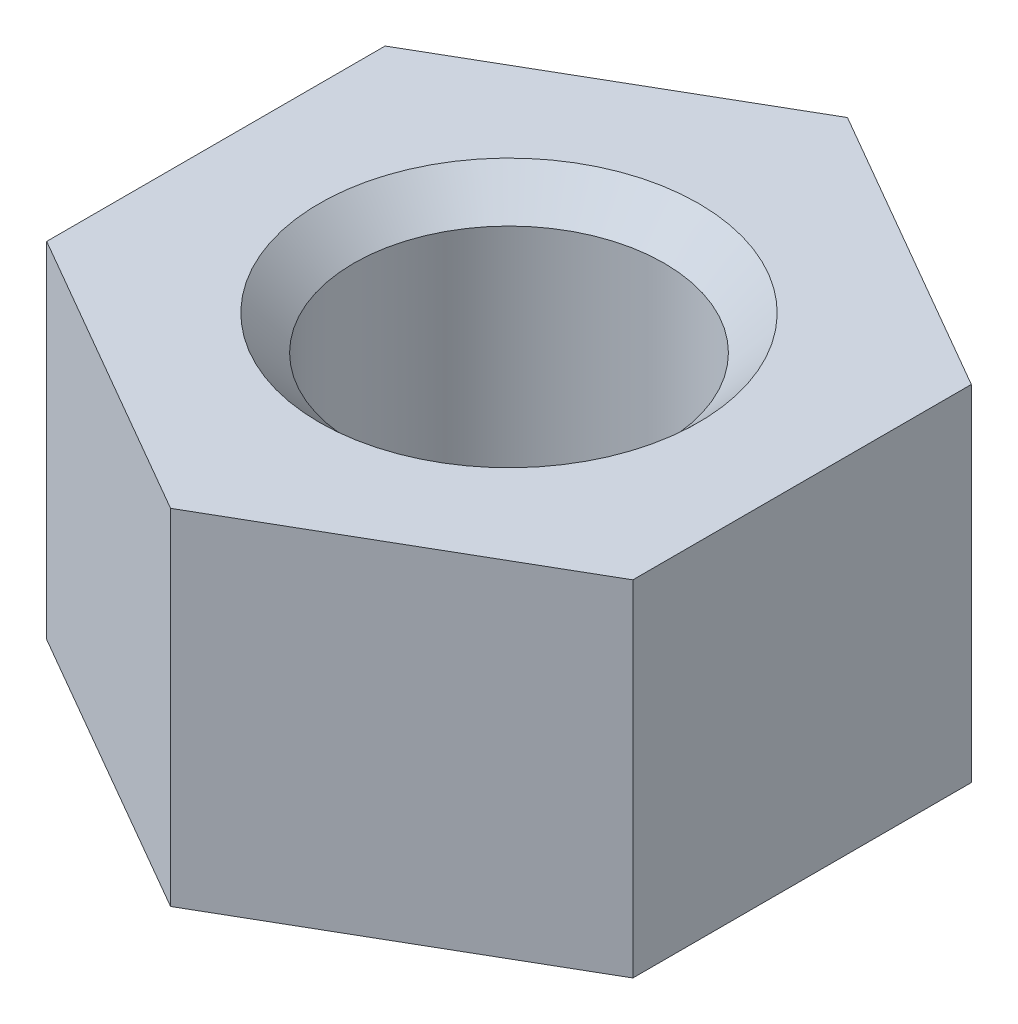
ISO-10303-21;
HEADER;
FILE_DESCRIPTION(('STEP AP214'),'2;1');
FILE_NAME('part.step','',(''),(''),'','','');
FILE_SCHEMA(('AUTOMOTIVE_DESIGN { 1 0 10303 214 1 1 1 1 }'));
ENDSEC;
DATA;
#1=APPLICATION_CONTEXT('core data for automotive mechanical design processes');
#2=APPLICATION_PROTOCOL_DEFINITION('international standard','automotive_design',2000,#1);
#3=PRODUCT_CONTEXT('',#1,'mechanical');
#4=PRODUCT('Part','Part','',(#3));
#5=PRODUCT_RELATED_PRODUCT_CATEGORY('part','',(#4));
#6=PRODUCT_DEFINITION_FORMATION('','',#4);
#7=PRODUCT_DEFINITION_CONTEXT('part definition',#1,'design');
#8=PRODUCT_DEFINITION('design','',#6,#7);
#9=PRODUCT_DEFINITION_SHAPE('','',#8);
#10=(LENGTH_UNIT() NAMED_UNIT(*) SI_UNIT(.MILLI.,.METRE.));
#11=(NAMED_UNIT(*) PLANE_ANGLE_UNIT() SI_UNIT($,.RADIAN.));
#12=(NAMED_UNIT(*) SI_UNIT($,.STERADIAN.) SOLID_ANGLE_UNIT());
#13=UNCERTAINTY_MEASURE_WITH_UNIT(LENGTH_MEASURE(1.E-05),#10,'distance_accuracy_value','');
#14=(GEOMETRIC_REPRESENTATION_CONTEXT(3) GLOBAL_UNCERTAINTY_ASSIGNED_CONTEXT((#13)) GLOBAL_UNIT_ASSIGNED_CONTEXT((#10,
#11,#12)) REPRESENTATION_CONTEXT('',''));
#15=CARTESIAN_POINT('',(0.,0.,0.));
#16=DIRECTION('',(0.,0.,1.));
#17=DIRECTION('',(1.,0.,0.));
#18=AXIS2_PLACEMENT_3D('',#15,#16,#17);
#19=CARTESIAN_POINT('',(0.,10.,0.));
#20=DIRECTION('',(0.,1.,0.));
#21=DIRECTION('',(0.,0.,1.));
#22=AXIS2_PLACEMENT_3D('',#19,#20,#21);
#23=PLANE('',#22);
#24=CARTESIAN_POINT('',(0.,10.,0.));
#25=DIRECTION('',(0.,1.,0.));
#26=DIRECTION('',(0.,0.,1.));
#27=AXIS2_PLACEMENT_3D('',#24,#25,#26);
#28=CIRCLE('',#27,5.50000000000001);
#29=CARTESIAN_POINT('',(0.,10.,5.50000000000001));
#30=VERTEX_POINT('',#29);
#31=EDGE_CURVE('E11',#30,#30,#28,.F.);
#32=ORIENTED_EDGE('',*,*,#31,.T.);
#33=EDGE_LOOP('',(#32));
#34=FACE_BOUND('',#33,.T.);
#35=DIRECTION('',(-0.866025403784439,0.,-0.5));
#36=VECTOR('',#35,1.);
#37=CARTESIAN_POINT('',(8.49999999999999,10.,-4.90747728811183));
#38=LINE('',#37,#36);
#39=CARTESIAN_POINT('',(8.49999999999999,10.,-4.90747728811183));
#40=VERTEX_POINT('',#39);
#41=CARTESIAN_POINT('',(0.,10.,-9.81495457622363));
#42=VERTEX_POINT('',#41);
#43=EDGE_CURVE('E142',#40,#42,#38,.T.);
#44=ORIENTED_EDGE('',*,*,#43,.T.);
#45=DIRECTION('',(-0.866025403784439,0.,0.5));
#46=VECTOR('',#45,1.);
#47=CARTESIAN_POINT('',(0.,10.,-9.81495457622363));
#48=LINE('',#47,#46);
#49=CARTESIAN_POINT('',(-8.49999999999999,10.,-4.90747728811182));
#50=VERTEX_POINT('',#49);
#51=EDGE_CURVE('E92',#42,#50,#48,.T.);
#52=ORIENTED_EDGE('',*,*,#51,.T.);
#53=DIRECTION('',(0.,0.,1.));
#54=VECTOR('',#53,1.);
#55=CARTESIAN_POINT('',(-8.49999999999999,10.,-4.90747728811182));
#56=LINE('',#55,#54);
#57=CARTESIAN_POINT('',(-8.49999999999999,10.,4.90747728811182));
#58=VERTEX_POINT('',#57);
#59=EDGE_CURVE('E104',#50,#58,#56,.T.);
#60=ORIENTED_EDGE('',*,*,#59,.T.);
#61=DIRECTION('',(0.866025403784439,0.,0.5));
#62=VECTOR('',#61,1.);
#63=CARTESIAN_POINT('',(-8.49999999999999,10.,4.90747728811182));
#64=LINE('',#63,#62);
#65=CARTESIAN_POINT('',(0.,10.,9.81495457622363));
#66=VERTEX_POINT('',#65);
#67=EDGE_CURVE('E99',#58,#66,#64,.T.);
#68=ORIENTED_EDGE('',*,*,#67,.T.);
#69=DIRECTION('',(0.866025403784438,0.,-0.5));
#70=VECTOR('',#69,1.);
#71=CARTESIAN_POINT('',(0.,10.,9.81495457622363));
#72=LINE('',#71,#70);
#73=CARTESIAN_POINT('',(8.49999999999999,10.,4.90747728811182));
#74=VERTEX_POINT('',#73);
#75=EDGE_CURVE('E102',#66,#74,#72,.T.);
#76=ORIENTED_EDGE('',*,*,#75,.T.);
#77=DIRECTION('',(0.,0.,-1.));
#78=VECTOR('',#77,1.);
#79=CARTESIAN_POINT('',(8.49999999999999,10.,4.90747728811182));
#80=LINE('',#79,#78);
#81=EDGE_CURVE('E54',#74,#40,#80,.T.);
#82=ORIENTED_EDGE('',*,*,#81,.T.);
#83=EDGE_LOOP('',(#44,#52,#60,#68,#76,#82));
#84=FACE_BOUND('',#83,.T.);
#85=ADVANCED_FACE('F36',(#34,#84),#23,.T.);
#86=CARTESIAN_POINT('',(0.,0.,0.));
#87=DIRECTION('',(0.,1.,0.));
#88=DIRECTION('',(0.,0.,1.));
#89=AXIS2_PLACEMENT_3D('',#86,#87,#88);
#90=PLANE('',#89);
#91=CARTESIAN_POINT('',(0.,0.,0.));
#92=DIRECTION('',(0.,1.,0.));
#93=DIRECTION('',(0.,0.,1.));
#94=AXIS2_PLACEMENT_3D('',#91,#92,#93);
#95=CIRCLE('',#94,5.50000000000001);
#96=CARTESIAN_POINT('',(0.,0.,5.50000000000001));
#97=VERTEX_POINT('',#96);
#98=EDGE_CURVE('E156',#97,#97,#95,.T.);
#99=ORIENTED_EDGE('',*,*,#98,.T.);
#100=EDGE_LOOP('',(#99));
#101=FACE_BOUND('',#100,.T.);
#102=DIRECTION('',(-0.866025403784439,0.,-0.5));
#103=VECTOR('',#102,1.);
#104=CARTESIAN_POINT('',(8.49999999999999,0.,-4.90747728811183));
#105=LINE('',#104,#103);
#106=CARTESIAN_POINT('',(8.49999999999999,0.,-4.90747728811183));
#107=VERTEX_POINT('',#106);
#108=CARTESIAN_POINT('',(0.,0.,-9.81495457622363));
#109=VERTEX_POINT('',#108);
#110=EDGE_CURVE('E127',#107,#109,#105,.T.);
#111=ORIENTED_EDGE('',*,*,#110,.F.);
#112=DIRECTION('',(0.,0.,-1.));
#113=VECTOR('',#112,1.);
#114=CARTESIAN_POINT('',(8.49999999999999,0.,4.90747728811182));
#115=LINE('',#114,#113);
#116=CARTESIAN_POINT('',(8.49999999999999,0.,4.90747728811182));
#117=VERTEX_POINT('',#116);
#118=EDGE_CURVE('E83',#117,#107,#115,.T.);
#119=ORIENTED_EDGE('',*,*,#118,.F.);
#120=DIRECTION('',(0.866025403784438,0.,-0.5));
#121=VECTOR('',#120,1.);
#122=CARTESIAN_POINT('',(0.,0.,9.81495457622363));
#123=LINE('',#122,#121);
#124=CARTESIAN_POINT('',(0.,0.,9.81495457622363));
#125=VERTEX_POINT('',#124);
#126=EDGE_CURVE('E77',#125,#117,#123,.T.);
#127=ORIENTED_EDGE('',*,*,#126,.F.);
#128=DIRECTION('',(0.866025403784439,0.,0.5));
#129=VECTOR('',#128,1.);
#130=CARTESIAN_POINT('',(-8.49999999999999,0.,4.90747728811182));
#131=LINE('',#130,#129);
#132=CARTESIAN_POINT('',(-8.49999999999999,0.,4.90747728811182));
#133=VERTEX_POINT('',#132);
#134=EDGE_CURVE('E113',#133,#125,#131,.T.);
#135=ORIENTED_EDGE('',*,*,#134,.F.);
#136=DIRECTION('',(0.,0.,1.));
#137=VECTOR('',#136,1.);
#138=CARTESIAN_POINT('',(-8.49999999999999,0.,-4.90747728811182));
#139=LINE('',#138,#137);
#140=CARTESIAN_POINT('',(-8.49999999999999,0.,-4.90747728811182));
#141=VERTEX_POINT('',#140);
#142=EDGE_CURVE('E134',#141,#133,#139,.T.);
#143=ORIENTED_EDGE('',*,*,#142,.F.);
#144=DIRECTION('',(-0.866025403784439,0.,0.5));
#145=VECTOR('',#144,1.);
#146=CARTESIAN_POINT('',(0.,0.,-9.81495457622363));
#147=LINE('',#146,#145);
#148=EDGE_CURVE('E131',#109,#141,#147,.T.);
#149=ORIENTED_EDGE('',*,*,#148,.F.);
#150=EDGE_LOOP('',(#111,#119,#127,#135,#143,#149));
#151=FACE_BOUND('',#150,.T.);
#152=ADVANCED_FACE('F176',(#101,#151),#90,.F.);
#153=CARTESIAN_POINT('',(8.49999999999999,10.,-4.90747728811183));
#154=DIRECTION('',(-0.5,0.,0.866025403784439));
#155=DIRECTION('',(0.866025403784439,0.,0.5));
#156=AXIS2_PLACEMENT_3D('',#153,#154,#155);
#157=PLANE('',#156);
#158=ORIENTED_EDGE('',*,*,#110,.T.);
#159=DIRECTION('',(0.,-1.,0.));
#160=VECTOR('',#159,1.);
#161=CARTESIAN_POINT('',(0.,10.,-9.81495457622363));
#162=LINE('',#161,#160);
#163=EDGE_CURVE('E153',#42,#109,#162,.T.);
#164=ORIENTED_EDGE('',*,*,#163,.F.);
#165=ORIENTED_EDGE('',*,*,#43,.F.);
#166=DIRECTION('',(0.,-1.,0.));
#167=VECTOR('',#166,1.);
#168=CARTESIAN_POINT('',(8.49999999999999,10.,-4.90747728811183));
#169=LINE('',#168,#167);
#170=EDGE_CURVE('E123',#40,#107,#169,.T.);
#171=ORIENTED_EDGE('',*,*,#170,.T.);
#172=EDGE_LOOP('',(#158,#164,#165,#171));
#173=FACE_BOUND('',#172,.T.);
#174=ADVANCED_FACE('F179',(#173),#157,.F.);
#175=CARTESIAN_POINT('',(0.,10.,-9.81495457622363));
#176=DIRECTION('',(0.5,0.,0.866025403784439));
#177=DIRECTION('',(0.866025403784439,0.,-0.5));
#178=AXIS2_PLACEMENT_3D('',#175,#176,#177);
#179=PLANE('',#178);
#180=ORIENTED_EDGE('',*,*,#148,.T.);
#181=DIRECTION('',(0.,-1.,0.));
#182=VECTOR('',#181,1.);
#183=CARTESIAN_POINT('',(-8.49999999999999,10.,-4.90747728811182));
#184=LINE('',#183,#182);
#185=EDGE_CURVE('E149',#50,#141,#184,.T.);
#186=ORIENTED_EDGE('',*,*,#185,.F.);
#187=ORIENTED_EDGE('',*,*,#51,.F.);
#188=ORIENTED_EDGE('',*,*,#163,.T.);
#189=EDGE_LOOP('',(#180,#186,#187,#188));
#190=FACE_BOUND('',#189,.T.);
#191=ADVANCED_FACE('F238',(#190),#179,.F.);
#192=CARTESIAN_POINT('',(-8.49999999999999,10.,-4.90747728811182));
#193=DIRECTION('',(1.,0.,0.));
#194=DIRECTION('',(0.,0.,-1.));
#195=AXIS2_PLACEMENT_3D('',#192,#193,#194);
#196=PLANE('',#195);
#197=ORIENTED_EDGE('',*,*,#142,.T.);
#198=DIRECTION('',(0.,-1.,0.));
#199=VECTOR('',#198,1.);
#200=CARTESIAN_POINT('',(-8.49999999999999,10.,4.90747728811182));
#201=LINE('',#200,#199);
#202=EDGE_CURVE('E115',#58,#133,#201,.T.);
#203=ORIENTED_EDGE('',*,*,#202,.F.);
#204=ORIENTED_EDGE('',*,*,#59,.F.);
#205=ORIENTED_EDGE('',*,*,#185,.T.);
#206=EDGE_LOOP('',(#197,#203,#204,#205));
#207=FACE_BOUND('',#206,.T.);
#208=ADVANCED_FACE('F230',(#207),#196,.F.);
#209=CARTESIAN_POINT('',(-8.49999999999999,10.,4.90747728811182));
#210=DIRECTION('',(0.5,0.,-0.866025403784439));
#211=DIRECTION('',(-0.866025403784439,0.,-0.5));
#212=AXIS2_PLACEMENT_3D('',#209,#210,#211);
#213=PLANE('',#212);
#214=ORIENTED_EDGE('',*,*,#134,.T.);
#215=DIRECTION('',(0.,-1.,0.));
#216=VECTOR('',#215,1.);
#217=CARTESIAN_POINT('',(0.,10.,9.81495457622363));
#218=LINE('',#217,#216);
#219=EDGE_CURVE('E110',#66,#125,#218,.T.);
#220=ORIENTED_EDGE('',*,*,#219,.F.);
#221=ORIENTED_EDGE('',*,*,#67,.F.);
#222=ORIENTED_EDGE('',*,*,#202,.T.);
#223=EDGE_LOOP('',(#214,#220,#221,#222));
#224=FACE_BOUND('',#223,.T.);
#225=ADVANCED_FACE('F111',(#224),#213,.F.);
#226=CARTESIAN_POINT('',(0.,10.,9.81495457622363));
#227=DIRECTION('',(-0.5,0.,-0.866025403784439));
#228=DIRECTION('',(-0.866025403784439,0.,0.5));
#229=AXIS2_PLACEMENT_3D('',#226,#227,#228);
#230=PLANE('',#229);
#231=ORIENTED_EDGE('',*,*,#126,.T.);
#232=DIRECTION('',(0.,-1.,0.));
#233=VECTOR('',#232,1.);
#234=CARTESIAN_POINT('',(8.49999999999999,10.,4.90747728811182));
#235=LINE('',#234,#233);
#236=EDGE_CURVE('E116',#74,#117,#235,.T.);
#237=ORIENTED_EDGE('',*,*,#236,.F.);
#238=ORIENTED_EDGE('',*,*,#75,.F.);
#239=ORIENTED_EDGE('',*,*,#219,.T.);
#240=EDGE_LOOP('',(#231,#237,#238,#239));
#241=FACE_BOUND('',#240,.T.);
#242=ADVANCED_FACE('F118',(#241),#230,.F.);
#243=CARTESIAN_POINT('',(8.49999999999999,10.,4.90747728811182));
#244=DIRECTION('',(-1.,0.,0.));
#245=DIRECTION('',(0.,0.,1.));
#246=AXIS2_PLACEMENT_3D('',#243,#244,#245);
#247=PLANE('',#246);
#248=ORIENTED_EDGE('',*,*,#118,.T.);
#249=ORIENTED_EDGE('',*,*,#170,.F.);
#250=ORIENTED_EDGE('',*,*,#81,.F.);
#251=ORIENTED_EDGE('',*,*,#236,.T.);
#252=EDGE_LOOP('',(#248,#249,#250,#251));
#253=FACE_BOUND('',#252,.T.);
#254=ADVANCED_FACE('F186',(#253),#247,.F.);
#255=CARTESIAN_POINT('',(0.,10.,0.));
#256=DIRECTION('',(0.,-1.,0.));
#257=DIRECTION('',(0.,0.,-1.));
#258=AXIS2_PLACEMENT_3D('',#255,#256,#257);
#259=CYLINDRICAL_SURFACE('',#258,4.5);
#260=CARTESIAN_POINT('',(0.,1.00000000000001,0.));
#261=DIRECTION('',(0.,1.,0.));
#262=DIRECTION('',(0.,0.,1.));
#263=AXIS2_PLACEMENT_3D('',#260,#261,#262);
#264=CIRCLE('',#263,4.5);
#265=CARTESIAN_POINT('',(0.,1.00000000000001,4.5));
#266=VERTEX_POINT('',#265);
#267=EDGE_CURVE('E46',#266,#266,#264,.F.);
#268=ORIENTED_EDGE('',*,*,#267,.T.);
#269=EDGE_LOOP('',(#268));
#270=FACE_BOUND('',#269,.T.);
#271=CARTESIAN_POINT('',(0.,9.,0.));
#272=DIRECTION('',(0.,1.,0.));
#273=DIRECTION('',(0.,0.,1.));
#274=AXIS2_PLACEMENT_3D('',#271,#272,#273);
#275=CIRCLE('',#274,4.5);
#276=CARTESIAN_POINT('',(0.,9.,4.5));
#277=VERTEX_POINT('',#276);
#278=EDGE_CURVE('E160',#277,#277,#275,.T.);
#279=ORIENTED_EDGE('',*,*,#278,.T.);
#280=EDGE_LOOP('',(#279));
#281=FACE_BOUND('',#280,.T.);
#282=ADVANCED_FACE('F168',(#270,#281),#259,.F.);
#283=CARTESIAN_POINT('',(0.,0.,0.));
#284=DIRECTION('',(0.,-1.,0.));
#285=DIRECTION('',(0.,0.,-1.));
#286=AXIS2_PLACEMENT_3D('',#283,#284,#285);
#287=CONICAL_SURFACE('',#286,5.50000000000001,0.785398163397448);
#288=ORIENTED_EDGE('',*,*,#267,.F.);
#289=EDGE_LOOP('',(#288));
#290=FACE_BOUND('',#289,.T.);
#291=ORIENTED_EDGE('',*,*,#98,.F.);
#292=EDGE_LOOP('',(#291));
#293=FACE_BOUND('',#292,.T.);
#294=ADVANCED_FACE('F171',(#290,#293),#287,.F.);
#295=CARTESIAN_POINT('',(0.,9.,0.));
#296=DIRECTION('',(0.,1.,0.));
#297=DIRECTION('',(0.,0.,1.));
#298=AXIS2_PLACEMENT_3D('',#295,#296,#297);
#299=CONICAL_SURFACE('',#298,4.5,0.78539816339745);
#300=ORIENTED_EDGE('',*,*,#31,.F.);
#301=EDGE_LOOP('',(#300));
#302=FACE_BOUND('',#301,.T.);
#303=ORIENTED_EDGE('',*,*,#278,.F.);
#304=EDGE_LOOP('',(#303));
#305=FACE_BOUND('',#304,.T.);
#306=ADVANCED_FACE('F38',(#302,#305),#299,.F.);
#307=CLOSED_SHELL('',(#85,#152,#174,#191,#208,#225,#242,#254,#282,#294,#306));
#308=MANIFOLD_SOLID_BREP('B2',#307);
#309=ADVANCED_BREP_SHAPE_REPRESENTATION('',(#18,#308),#14);
#310=SHAPE_DEFINITION_REPRESENTATION(#9,#309);
ENDSEC;
END-ISO-10303-21;
